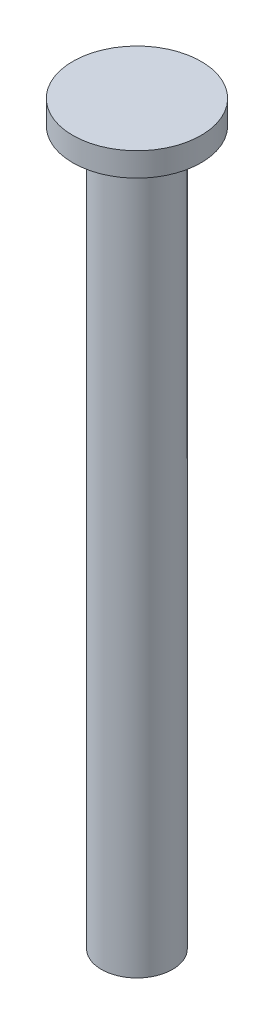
ISO-10303-21;
HEADER;
FILE_DESCRIPTION(('STEP AP214'),'2;1');
FILE_NAME('part.step','',(''),(''),'','','');
FILE_SCHEMA(('AUTOMOTIVE_DESIGN { 1 0 10303 214 1 1 1 1 }'));
ENDSEC;
DATA;
#1=APPLICATION_CONTEXT('core data for automotive mechanical design processes');
#2=APPLICATION_PROTOCOL_DEFINITION('international standard','automotive_design',2000,#1);
#3=PRODUCT_CONTEXT('',#1,'mechanical');
#4=PRODUCT('Part','Part','',(#3));
#5=PRODUCT_RELATED_PRODUCT_CATEGORY('part','',(#4));
#6=PRODUCT_DEFINITION_FORMATION('','',#4);
#7=PRODUCT_DEFINITION_CONTEXT('part definition',#1,'design');
#8=PRODUCT_DEFINITION('design','',#6,#7);
#9=PRODUCT_DEFINITION_SHAPE('','',#8);
#10=(LENGTH_UNIT() NAMED_UNIT(*) SI_UNIT(.MILLI.,.METRE.));
#11=(NAMED_UNIT(*) PLANE_ANGLE_UNIT() SI_UNIT($,.RADIAN.));
#12=(NAMED_UNIT(*) SI_UNIT($,.STERADIAN.) SOLID_ANGLE_UNIT());
#13=UNCERTAINTY_MEASURE_WITH_UNIT(LENGTH_MEASURE(1.E-05),#10,'distance_accuracy_value','');
#14=(GEOMETRIC_REPRESENTATION_CONTEXT(3) GLOBAL_UNCERTAINTY_ASSIGNED_CONTEXT((#13)) GLOBAL_UNIT_ASSIGNED_CONTEXT((#10,
#11,#12)) REPRESENTATION_CONTEXT('',''));
#15=CARTESIAN_POINT('',(0.,0.,0.));
#16=DIRECTION('',(0.,0.,1.));
#17=DIRECTION('',(1.,0.,0.));
#18=AXIS2_PLACEMENT_3D('',#15,#16,#17);
#19=CARTESIAN_POINT('',(0.,1.,0.));
#20=DIRECTION('',(0.,-1.,0.));
#21=DIRECTION('',(0.,0.,-1.));
#22=AXIS2_PLACEMENT_3D('',#19,#20,#21);
#23=CYLINDRICAL_SURFACE('',#22,2.7);
#24=CARTESIAN_POINT('',(0.,1.,0.));
#25=DIRECTION('',(0.,1.,0.));
#26=DIRECTION('',(0.,0.,1.));
#27=AXIS2_PLACEMENT_3D('',#24,#25,#26);
#28=CIRCLE('',#27,2.7);
#29=CARTESIAN_POINT('',(0.,1.,2.7));
#30=VERTEX_POINT('',#29);
#31=EDGE_CURVE('E43',#30,#30,#28,.T.);
#32=ORIENTED_EDGE('',*,*,#31,.F.);
#33=EDGE_LOOP('',(#32));
#34=FACE_BOUND('',#33,.T.);
#35=CARTESIAN_POINT('',(0.,0.,0.));
#36=DIRECTION('',(0.,1.,0.));
#37=DIRECTION('',(0.,0.,1.));
#38=AXIS2_PLACEMENT_3D('',#35,#36,#37);
#39=CIRCLE('',#38,2.7);
#40=CARTESIAN_POINT('',(0.,0.,2.7));
#41=VERTEX_POINT('',#40);
#42=EDGE_CURVE('E39',#41,#41,#39,.T.);
#43=ORIENTED_EDGE('',*,*,#42,.T.);
#44=EDGE_LOOP('',(#43));
#45=FACE_BOUND('',#44,.T.);
#46=ADVANCED_FACE('F36',(#34,#45),#23,.T.);
#47=CARTESIAN_POINT('',(0.,1.,0.));
#48=DIRECTION('',(0.,1.,0.));
#49=DIRECTION('',(0.,0.,1.));
#50=AXIS2_PLACEMENT_3D('',#47,#48,#49);
#51=PLANE('',#50);
#52=ORIENTED_EDGE('',*,*,#31,.T.);
#53=EDGE_LOOP('',(#52));
#54=FACE_BOUND('',#53,.T.);
#55=ADVANCED_FACE('F60',(#54),#51,.T.);
#56=CARTESIAN_POINT('',(0.,0.,0.));
#57=DIRECTION('',(0.,1.,0.));
#58=DIRECTION('',(0.,0.,1.));
#59=AXIS2_PLACEMENT_3D('',#56,#57,#58);
#60=PLANE('',#59);
#61=CARTESIAN_POINT('',(0.,0.,0.));
#62=DIRECTION('',(0.,-1.,0.));
#63=DIRECTION('',(0.,0.,-1.));
#64=AXIS2_PLACEMENT_3D('',#61,#62,#63);
#65=CIRCLE('',#64,1.5);
#66=CARTESIAN_POINT('',(0.,0.,-1.5));
#67=VERTEX_POINT('',#66);
#68=EDGE_CURVE('E10',#67,#67,#65,.T.);
#69=ORIENTED_EDGE('',*,*,#68,.F.);
#70=EDGE_LOOP('',(#69));
#71=FACE_BOUND('',#70,.T.);
#72=ORIENTED_EDGE('',*,*,#42,.F.);
#73=EDGE_LOOP('',(#72));
#74=FACE_BOUND('',#73,.T.);
#75=ADVANCED_FACE('F57',(#71,#74),#60,.F.);
#76=CARTESIAN_POINT('',(0.,-30.,0.));
#77=DIRECTION('',(0.,1.,0.));
#78=DIRECTION('',(0.,0.,1.));
#79=AXIS2_PLACEMENT_3D('',#76,#77,#78);
#80=CYLINDRICAL_SURFACE('',#79,1.5);
#81=CARTESIAN_POINT('',(0.,-30.,0.));
#82=DIRECTION('',(0.,-1.,0.));
#83=DIRECTION('',(0.,0.,-1.));
#84=AXIS2_PLACEMENT_3D('',#81,#82,#83);
#85=CIRCLE('',#84,1.5);
#86=CARTESIAN_POINT('',(0.,-30.,-1.5));
#87=VERTEX_POINT('',#86);
#88=EDGE_CURVE('E49',#87,#87,#85,.T.);
#89=ORIENTED_EDGE('',*,*,#88,.F.);
#90=EDGE_LOOP('',(#89));
#91=FACE_BOUND('',#90,.T.);
#92=ORIENTED_EDGE('',*,*,#68,.T.);
#93=EDGE_LOOP('',(#92));
#94=FACE_BOUND('',#93,.T.);
#95=ADVANCED_FACE('F59',(#91,#94),#80,.T.);
#96=CARTESIAN_POINT('',(0.,-30.,0.));
#97=DIRECTION('',(0.,-1.,0.));
#98=DIRECTION('',(0.,0.,-1.));
#99=AXIS2_PLACEMENT_3D('',#96,#97,#98);
#100=PLANE('',#99);
#101=ORIENTED_EDGE('',*,*,#88,.T.);
#102=EDGE_LOOP('',(#101));
#103=FACE_BOUND('',#102,.T.);
#104=ADVANCED_FACE('F66',(#103),#100,.T.);
#105=CLOSED_SHELL('',(#46,#55,#75,#95,#104));
#106=MANIFOLD_SOLID_BREP('B2',#105);
#107=ADVANCED_BREP_SHAPE_REPRESENTATION('',(#18,#106),#14);
#108=SHAPE_DEFINITION_REPRESENTATION(#9,#107);
ENDSEC;
END-ISO-10303-21;
